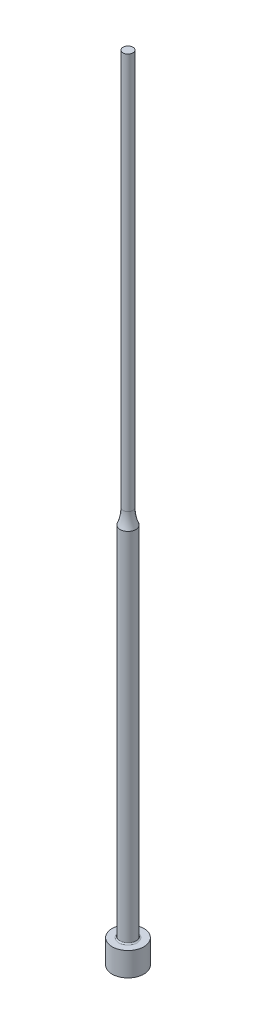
from build123d import *


with BuildPart() as part:
    # Sketch1 → Revolve1 (revolve)
    with BuildSketch(Plane.XY, mode=Mode.PRIVATE) as revolve1_sk:
        with BuildLine():
            Line((0, 0), (4, 0))
            Line((4, 0), (4, 6))
            Line((4, 6), (2.3, 6))
            ThreePointArc((2.3, 6), (2.087867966, 6.087867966), (2, 6.3))
            Line((2, 6.3), (2, 96.200328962))
            ThreePointArc((2, 96.200328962), (1.439291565, 98.063508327), (1.25, 100))
            Line((1.25, 100), (1.25, 200))
            Line((1.25, 200), (0, 200))
            Line((0, 200), (0, 0))
        make_face()
    revolve(revolve1_sk.sketch.rotate(Axis((0, 200, 0), (0, -1, 0)), 180), axis=Axis((0, 200, 0), (0, -1, 0)))


solid = part.part
